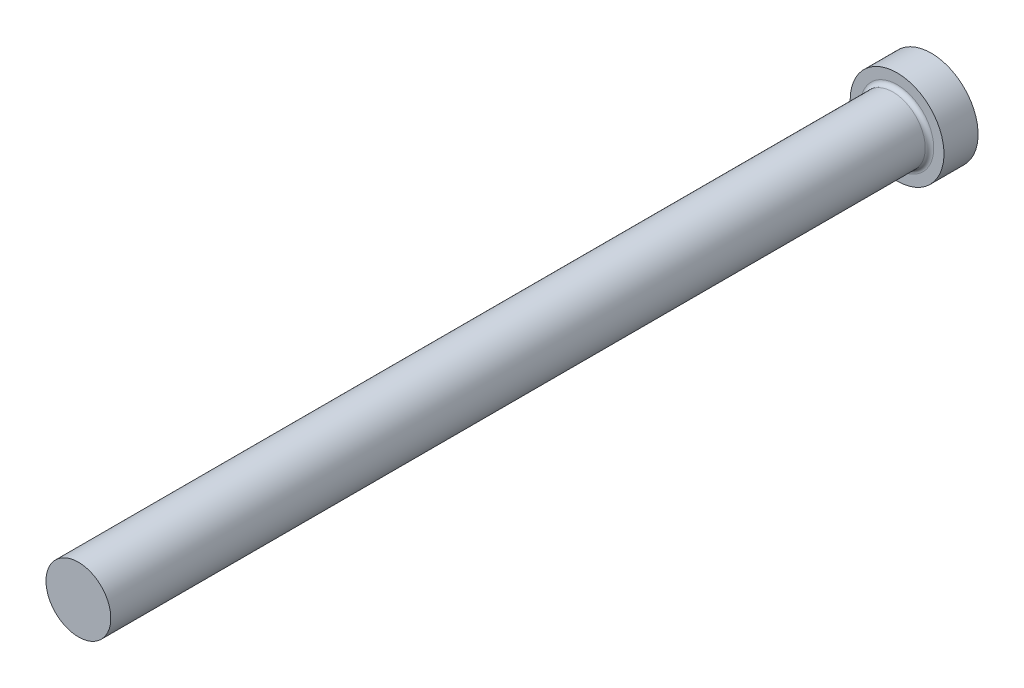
from build123d import *

# Parameters (mm, degrees)
FILLET1_R = 0.5


with BuildPart() as part:
    # FV → Revolve1 (revolve)
    with BuildSketch(Plane(origin=(0, 0, 0), x_dir=(1, 0, 0), z_dir=(0, 1, 0)), mode=Mode.PRIVATE) as revolve1_sk:
        Polygon((0, 0), (5.5, 0), (5.5, -4), (3.8, -4), (3.8, -100), (0, -100), align=None)
    revolve(revolve1_sk.sketch.rotate(Axis((0, 0, -9.033228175), (0, 0, 1)), 180), axis=Axis((0, 0, -9.033228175), (0, 0, 1)))

    # Fillet1
    fillet1_edges = [part.edges().sort_by_distance(p)[0] for p in [
        (3.8, 0, 4),
    ]]
    fillet(fillet1_edges, radius=FILLET1_R)


solid = part.part
